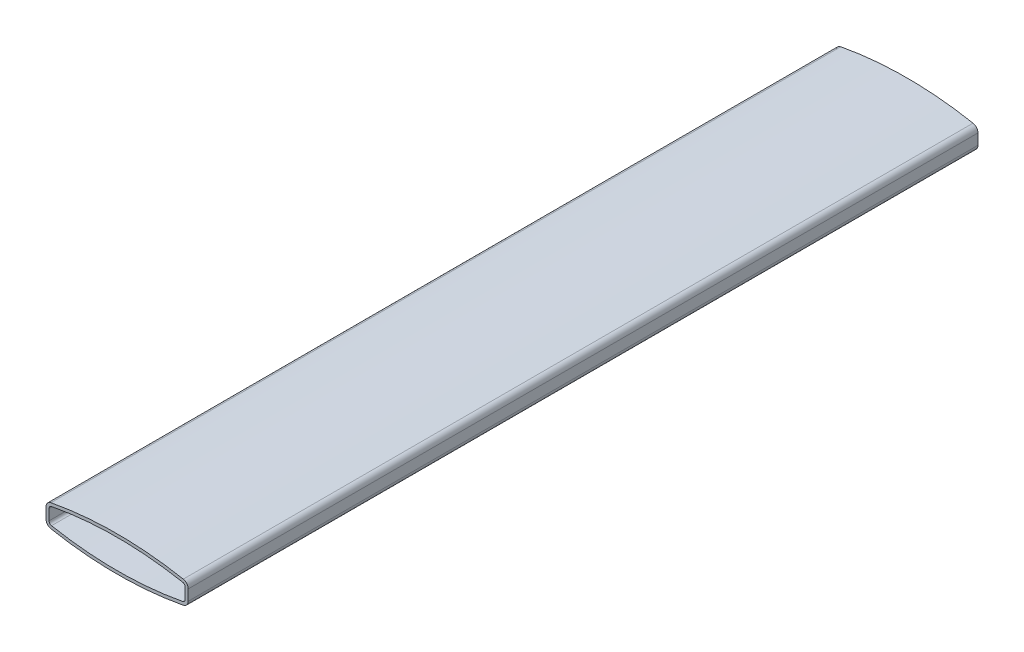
ISO-10303-21;
HEADER;
FILE_DESCRIPTION(('STEP AP214'),'2;1');
FILE_NAME('part.step','',(''),(''),'','','');
FILE_SCHEMA(('AUTOMOTIVE_DESIGN { 1 0 10303 214 1 1 1 1 }'));
ENDSEC;
DATA;
#1=APPLICATION_CONTEXT('core data for automotive mechanical design processes');
#2=APPLICATION_PROTOCOL_DEFINITION('international standard','automotive_design',2000,#1);
#3=PRODUCT_CONTEXT('',#1,'mechanical');
#4=PRODUCT('Part','Part','',(#3));
#5=PRODUCT_RELATED_PRODUCT_CATEGORY('part','',(#4));
#6=PRODUCT_DEFINITION_FORMATION('','',#4);
#7=PRODUCT_DEFINITION_CONTEXT('part definition',#1,'design');
#8=PRODUCT_DEFINITION('design','',#6,#7);
#9=PRODUCT_DEFINITION_SHAPE('','',#8);
#10=(LENGTH_UNIT() NAMED_UNIT(*) SI_UNIT(.MILLI.,.METRE.));
#11=(NAMED_UNIT(*) PLANE_ANGLE_UNIT() SI_UNIT($,.RADIAN.));
#12=(NAMED_UNIT(*) SI_UNIT($,.STERADIAN.) SOLID_ANGLE_UNIT());
#13=UNCERTAINTY_MEASURE_WITH_UNIT(LENGTH_MEASURE(1.E-05),#10,'distance_accuracy_value','');
#14=(GEOMETRIC_REPRESENTATION_CONTEXT(3) GLOBAL_UNCERTAINTY_ASSIGNED_CONTEXT((#13)) GLOBAL_UNIT_ASSIGNED_CONTEXT((#10,
#11,#12)) REPRESENTATION_CONTEXT('',''));
#15=CARTESIAN_POINT('',(0.,0.,0.));
#16=DIRECTION('',(0.,0.,1.));
#17=DIRECTION('',(1.,0.,0.));
#18=AXIS2_PLACEMENT_3D('',#15,#16,#17);
#19=CARTESIAN_POINT('',(0.,-166.375,0.));
#20=DIRECTION('',(0.,0.,1.));
#21=DIRECTION('',(1.,0.,0.));
#22=AXIS2_PLACEMENT_3D('',#19,#20,#21);
#23=PLANE('',#22);
#24=DIRECTION('',(0.,1.,0.));
#25=VECTOR('',#24,1.);
#26=CARTESIAN_POINT('',(35.,0.,0.));
#27=LINE('',#26,#25);
#28=CARTESIAN_POINT('',(35.,-2.62204139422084,0.));
#29=VERTEX_POINT('',#28);
#30=CARTESIAN_POINT('',(35.,2.62204139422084,0.));
#31=VERTEX_POINT('',#30);
#32=EDGE_CURVE('E226',#29,#31,#27,.T.);
#33=ORIENTED_EDGE('',*,*,#32,.F.);
#34=CARTESIAN_POINT('',(32.,-2.62204139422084,0.));
#35=DIRECTION('',(0.,0.,1.));
#36=DIRECTION('',(1.,0.,0.));
#37=AXIS2_PLACEMENT_3D('',#34,#35,#36);
#38=CIRCLE('',#37,3.);
#39=CARTESIAN_POINT('',(32.5581395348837,-5.56966420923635,0.));
#40=VERTEX_POINT('',#39);
#41=EDGE_CURVE('E241',#29,#40,#38,.F.);
#42=ORIENTED_EDGE('',*,*,#41,.T.);
#43=CARTESIAN_POINT('',(0.,166.375,0.));
#44=DIRECTION('',(0.,0.,1.));
#45=DIRECTION('',(1.,0.,0.));
#46=AXIS2_PLACEMENT_3D('',#43,#44,#45);
#47=CIRCLE('',#46,175.);
#48=CARTESIAN_POINT('',(-32.5581395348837,-5.56966420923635,0.));
#49=VERTEX_POINT('',#48);
#50=EDGE_CURVE('E223',#49,#40,#47,.T.);
#51=ORIENTED_EDGE('',*,*,#50,.F.);
#52=CARTESIAN_POINT('',(-32.,-2.62204139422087,0.));
#53=DIRECTION('',(0.,0.,1.));
#54=DIRECTION('',(1.,0.,0.));
#55=AXIS2_PLACEMENT_3D('',#52,#53,#54);
#56=CIRCLE('',#55,3.);
#57=CARTESIAN_POINT('',(-35.,-2.62204139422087,0.));
#58=VERTEX_POINT('',#57);
#59=EDGE_CURVE('E237',#49,#58,#56,.F.);
#60=ORIENTED_EDGE('',*,*,#59,.T.);
#61=DIRECTION('',(0.,-1.,0.));
#62=VECTOR('',#61,1.);
#63=CARTESIAN_POINT('',(-35.,0.,0.));
#64=LINE('',#63,#62);
#65=CARTESIAN_POINT('',(-35.,2.62204139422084,0.));
#66=VERTEX_POINT('',#65);
#67=EDGE_CURVE('E220',#66,#58,#64,.T.);
#68=ORIENTED_EDGE('',*,*,#67,.F.);
#69=CARTESIAN_POINT('',(-32.,2.62204139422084,0.));
#70=DIRECTION('',(0.,0.,1.));
#71=DIRECTION('',(1.,0.,0.));
#72=AXIS2_PLACEMENT_3D('',#69,#70,#71);
#73=CIRCLE('',#72,3.);
#74=CARTESIAN_POINT('',(-32.5581395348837,5.56966420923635,0.));
#75=VERTEX_POINT('',#74);
#76=EDGE_CURVE('E235',#66,#75,#73,.F.);
#77=ORIENTED_EDGE('',*,*,#76,.T.);
#78=CARTESIAN_POINT('',(0.,-166.375,0.));
#79=DIRECTION('',(0.,0.,1.));
#80=DIRECTION('',(1.,0.,0.));
#81=AXIS2_PLACEMENT_3D('',#78,#79,#80);
#82=CIRCLE('',#81,175.);
#83=CARTESIAN_POINT('',(32.5581395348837,5.56966420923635,0.));
#84=VERTEX_POINT('',#83);
#85=EDGE_CURVE('E210',#84,#75,#82,.T.);
#86=ORIENTED_EDGE('',*,*,#85,.F.);
#87=CARTESIAN_POINT('',(32.,2.62204139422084,0.));
#88=DIRECTION('',(0.,0.,1.));
#89=DIRECTION('',(1.,0.,0.));
#90=AXIS2_PLACEMENT_3D('',#87,#88,#89);
#91=CIRCLE('',#90,3.);
#92=EDGE_CURVE('E239',#84,#31,#91,.F.);
#93=ORIENTED_EDGE('',*,*,#92,.T.);
#94=EDGE_LOOP('',(#33,#42,#51,#60,#68,#77,#86,#93));
#95=FACE_BOUND('',#94,.T.);
#96=CARTESIAN_POINT('',(32.,-2.62204139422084,0.));
#97=DIRECTION('',(0.,0.,1.));
#98=DIRECTION('',(1.,0.,0.));
#99=AXIS2_PLACEMENT_3D('',#96,#97,#98);
#100=CIRCLE('',#99,1.5);
#101=CARTESIAN_POINT('',(33.5,-2.62204139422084,0.));
#102=VERTEX_POINT('',#101);
#103=CARTESIAN_POINT('',(32.2790697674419,-4.09585280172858,0.));
#104=VERTEX_POINT('',#103);
#105=EDGE_CURVE('E180',#102,#104,#100,.F.);
#106=ORIENTED_EDGE('',*,*,#105,.F.);
#107=DIRECTION('',(0.,1.,0.));
#108=VECTOR('',#107,1.);
#109=CARTESIAN_POINT('',(33.5,0.,0.));
#110=LINE('',#109,#108);
#111=CARTESIAN_POINT('',(33.5,2.62204139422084,0.));
#112=VERTEX_POINT('',#111);
#113=EDGE_CURVE('E178',#102,#112,#110,.T.);
#114=ORIENTED_EDGE('',*,*,#113,.T.);
#115=CARTESIAN_POINT('',(32.,2.62204139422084,0.));
#116=DIRECTION('',(0.,0.,1.));
#117=DIRECTION('',(1.,0.,0.));
#118=AXIS2_PLACEMENT_3D('',#115,#116,#117);
#119=CIRCLE('',#118,1.5);
#120=CARTESIAN_POINT('',(32.2790697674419,4.09585280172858,0.));
#121=VERTEX_POINT('',#120);
#122=EDGE_CURVE('E171',#121,#112,#119,.F.);
#123=ORIENTED_EDGE('',*,*,#122,.F.);
#124=CARTESIAN_POINT('',(0.,-166.375,0.));
#125=DIRECTION('',(0.,0.,1.));
#126=DIRECTION('',(1.,0.,0.));
#127=AXIS2_PLACEMENT_3D('',#124,#125,#126);
#128=CIRCLE('',#127,173.5);
#129=CARTESIAN_POINT('',(-32.2790697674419,4.09585280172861,0.));
#130=VERTEX_POINT('',#129);
#131=EDGE_CURVE('E58',#121,#130,#128,.T.);
#132=ORIENTED_EDGE('',*,*,#131,.T.);
#133=CARTESIAN_POINT('',(-32.,2.62204139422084,0.));
#134=DIRECTION('',(0.,0.,1.));
#135=DIRECTION('',(1.,0.,0.));
#136=AXIS2_PLACEMENT_3D('',#133,#134,#135);
#137=CIRCLE('',#136,1.5);
#138=CARTESIAN_POINT('',(-33.5,2.62204139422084,0.));
#139=VERTEX_POINT('',#138);
#140=EDGE_CURVE('E153',#139,#130,#137,.F.);
#141=ORIENTED_EDGE('',*,*,#140,.F.);
#142=DIRECTION('',(0.,-1.,0.));
#143=VECTOR('',#142,1.);
#144=CARTESIAN_POINT('',(-33.5,0.,0.));
#145=LINE('',#144,#143);
#146=CARTESIAN_POINT('',(-33.5,-2.62204139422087,0.));
#147=VERTEX_POINT('',#146);
#148=EDGE_CURVE('E160',#139,#147,#145,.T.);
#149=ORIENTED_EDGE('',*,*,#148,.T.);
#150=CARTESIAN_POINT('',(-32.,-2.62204139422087,0.));
#151=DIRECTION('',(0.,0.,1.));
#152=DIRECTION('',(1.,0.,0.));
#153=AXIS2_PLACEMENT_3D('',#150,#151,#152);
#154=CIRCLE('',#153,1.5);
#155=CARTESIAN_POINT('',(-32.2790697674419,-4.09585280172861,0.));
#156=VERTEX_POINT('',#155);
#157=EDGE_CURVE('E168',#156,#147,#154,.F.);
#158=ORIENTED_EDGE('',*,*,#157,.F.);
#159=CARTESIAN_POINT('',(0.,166.375,0.));
#160=DIRECTION('',(0.,0.,1.));
#161=DIRECTION('',(1.,0.,0.));
#162=AXIS2_PLACEMENT_3D('',#159,#160,#161);
#163=CIRCLE('',#162,173.5);
#164=EDGE_CURVE('E164',#156,#104,#163,.T.);
#165=ORIENTED_EDGE('',*,*,#164,.T.);
#166=EDGE_LOOP('',(#106,#114,#123,#132,#141,#149,#158,#165));
#167=FACE_BOUND('',#166,.T.);
#168=ADVANCED_FACE('F35',(#95,#167),#23,.F.);
#169=CARTESIAN_POINT('',(-35.,0.,388.65));
#170=DIRECTION('',(1.,0.,0.));
#171=DIRECTION('',(0.,1.,0.));
#172=AXIS2_PLACEMENT_3D('',#169,#170,#171);
#173=PLANE('',#172);
#174=ORIENTED_EDGE('',*,*,#67,.T.);
#175=DIRECTION('',(0.,0.,-1.));
#176=VECTOR('',#175,1.);
#177=CARTESIAN_POINT('',(-35.,-2.62204139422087,388.65));
#178=LINE('',#177,#176);
#179=CARTESIAN_POINT('',(-35.,-2.62204139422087,388.65));
#180=VERTEX_POINT('',#179);
#181=EDGE_CURVE('E11',#58,#180,#178,.F.);
#182=ORIENTED_EDGE('',*,*,#181,.T.);
#183=DIRECTION('',(0.,-1.,0.));
#184=VECTOR('',#183,1.);
#185=CARTESIAN_POINT('',(-35.,0.,388.65));
#186=LINE('',#185,#184);
#187=CARTESIAN_POINT('',(-35.,2.62204139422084,388.65));
#188=VERTEX_POINT('',#187);
#189=EDGE_CURVE('E206',#188,#180,#186,.T.);
#190=ORIENTED_EDGE('',*,*,#189,.F.);
#191=DIRECTION('',(0.,0.,-1.));
#192=VECTOR('',#191,1.);
#193=CARTESIAN_POINT('',(-35.,2.62204139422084,388.65));
#194=LINE('',#193,#192);
#195=EDGE_CURVE('E43',#188,#66,#194,.T.);
#196=ORIENTED_EDGE('',*,*,#195,.T.);
#197=EDGE_LOOP('',(#174,#182,#190,#196));
#198=FACE_BOUND('',#197,.T.);
#199=ADVANCED_FACE('F265',(#198),#173,.F.);
#200=CARTESIAN_POINT('',(0.,166.375,388.65));
#201=DIRECTION('',(0.,0.,-1.));
#202=DIRECTION('',(-1.,0.,0.));
#203=AXIS2_PLACEMENT_3D('',#200,#201,#202);
#204=CYLINDRICAL_SURFACE('',#203,175.);
#205=ORIENTED_EDGE('',*,*,#50,.T.);
#206=DIRECTION('',(0.,0.,-1.));
#207=VECTOR('',#206,1.);
#208=CARTESIAN_POINT('',(32.5581395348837,-5.56966420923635,388.65));
#209=LINE('',#208,#207);
#210=CARTESIAN_POINT('',(32.5581395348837,-5.56966420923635,388.65));
#211=VERTEX_POINT('',#210);
#212=EDGE_CURVE('E246',#40,#211,#209,.F.);
#213=ORIENTED_EDGE('',*,*,#212,.T.);
#214=CARTESIAN_POINT('',(0.,166.375,388.65));
#215=DIRECTION('',(0.,0.,1.));
#216=DIRECTION('',(1.,0.,0.));
#217=AXIS2_PLACEMENT_3D('',#214,#215,#216);
#218=CIRCLE('',#217,175.);
#219=CARTESIAN_POINT('',(-32.5581395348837,-5.56966420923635,388.65));
#220=VERTEX_POINT('',#219);
#221=EDGE_CURVE('E209',#220,#211,#218,.T.);
#222=ORIENTED_EDGE('',*,*,#221,.F.);
#223=DIRECTION('',(0.,0.,-1.));
#224=VECTOR('',#223,1.);
#225=CARTESIAN_POINT('',(-32.5581395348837,-5.56966420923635,388.65));
#226=LINE('',#225,#224);
#227=EDGE_CURVE('E243',#220,#49,#226,.T.);
#228=ORIENTED_EDGE('',*,*,#227,.T.);
#229=EDGE_LOOP('',(#205,#213,#222,#228));
#230=FACE_BOUND('',#229,.T.);
#231=ADVANCED_FACE('F279',(#230),#204,.T.);
#232=CARTESIAN_POINT('',(35.,0.,388.65));
#233=DIRECTION('',(-1.,0.,0.));
#234=DIRECTION('',(0.,0.,1.));
#235=AXIS2_PLACEMENT_3D('',#232,#233,#234);
#236=PLANE('',#235);
#237=DIRECTION('',(0.,1.,0.));
#238=VECTOR('',#237,1.);
#239=CARTESIAN_POINT('',(35.,0.,388.65));
#240=LINE('',#239,#238);
#241=CARTESIAN_POINT('',(35.,-2.62204139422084,388.65));
#242=VERTEX_POINT('',#241);
#243=CARTESIAN_POINT('',(35.,2.62204139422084,388.65));
#244=VERTEX_POINT('',#243);
#245=EDGE_CURVE('E213',#242,#244,#240,.T.);
#246=ORIENTED_EDGE('',*,*,#245,.F.);
#247=DIRECTION('',(0.,0.,-1.));
#248=VECTOR('',#247,1.);
#249=CARTESIAN_POINT('',(35.,-2.62204139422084,388.65));
#250=LINE('',#249,#248);
#251=EDGE_CURVE('E232',#242,#29,#250,.T.);
#252=ORIENTED_EDGE('',*,*,#251,.T.);
#253=ORIENTED_EDGE('',*,*,#32,.T.);
#254=DIRECTION('',(0.,0.,-1.));
#255=VECTOR('',#254,1.);
#256=CARTESIAN_POINT('',(35.,2.62204139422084,388.65));
#257=LINE('',#256,#255);
#258=EDGE_CURVE('E219',#31,#244,#257,.F.);
#259=ORIENTED_EDGE('',*,*,#258,.T.);
#260=EDGE_LOOP('',(#246,#252,#253,#259));
#261=FACE_BOUND('',#260,.T.);
#262=ADVANCED_FACE('F289',(#261),#236,.F.);
#263=CARTESIAN_POINT('',(0.,-166.375,388.65));
#264=DIRECTION('',(0.,0.,-1.));
#265=DIRECTION('',(-1.,0.,0.));
#266=AXIS2_PLACEMENT_3D('',#263,#264,#265);
#267=CYLINDRICAL_SURFACE('',#266,175.);
#268=CARTESIAN_POINT('',(0.,-166.375,388.65));
#269=DIRECTION('',(0.,0.,1.));
#270=DIRECTION('',(1.,0.,0.));
#271=AXIS2_PLACEMENT_3D('',#268,#269,#270);
#272=CIRCLE('',#271,175.);
#273=CARTESIAN_POINT('',(32.5581395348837,5.56966420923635,388.65));
#274=VERTEX_POINT('',#273);
#275=CARTESIAN_POINT('',(-32.5581395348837,5.56966420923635,388.65));
#276=VERTEX_POINT('',#275);
#277=EDGE_CURVE('E216',#274,#276,#272,.T.);
#278=ORIENTED_EDGE('',*,*,#277,.F.);
#279=DIRECTION('',(0.,0.,-1.));
#280=VECTOR('',#279,1.);
#281=CARTESIAN_POINT('',(32.5581395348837,5.56966420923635,388.65));
#282=LINE('',#281,#280);
#283=EDGE_CURVE('E258',#274,#84,#282,.T.);
#284=ORIENTED_EDGE('',*,*,#283,.T.);
#285=ORIENTED_EDGE('',*,*,#85,.T.);
#286=DIRECTION('',(0.,0.,-1.));
#287=VECTOR('',#286,1.);
#288=CARTESIAN_POINT('',(-32.5581395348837,5.56966420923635,388.65));
#289=LINE('',#288,#287);
#290=EDGE_CURVE('E256',#75,#276,#289,.F.);
#291=ORIENTED_EDGE('',*,*,#290,.T.);
#292=EDGE_LOOP('',(#278,#284,#285,#291));
#293=FACE_BOUND('',#292,.T.);
#294=ADVANCED_FACE('F297',(#293),#267,.T.);
#295=CARTESIAN_POINT('',(0.,-166.375,388.65));
#296=DIRECTION('',(0.,0.,1.));
#297=DIRECTION('',(1.,0.,0.));
#298=AXIS2_PLACEMENT_3D('',#295,#296,#297);
#299=PLANE('',#298);
#300=CARTESIAN_POINT('',(0.,166.375,388.65));
#301=DIRECTION('',(0.,0.,1.));
#302=DIRECTION('',(1.,0.,0.));
#303=AXIS2_PLACEMENT_3D('',#300,#301,#302);
#304=CIRCLE('',#303,173.5);
#305=CARTESIAN_POINT('',(-32.2790697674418,-4.09585280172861,388.65));
#306=VERTEX_POINT('',#305);
#307=CARTESIAN_POINT('',(32.2790697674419,-4.09585280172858,388.65));
#308=VERTEX_POINT('',#307);
#309=EDGE_CURVE('E188',#306,#308,#304,.T.);
#310=ORIENTED_EDGE('',*,*,#309,.F.);
#311=CARTESIAN_POINT('',(-32.,-2.62204139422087,388.65));
#312=DIRECTION('',(0.,0.,1.));
#313=DIRECTION('',(1.,0.,0.));
#314=AXIS2_PLACEMENT_3D('',#311,#312,#313);
#315=CIRCLE('',#314,1.5);
#316=CARTESIAN_POINT('',(-33.5,-2.62204139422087,388.65));
#317=VERTEX_POINT('',#316);
#318=EDGE_CURVE('E189',#317,#306,#315,.T.);
#319=ORIENTED_EDGE('',*,*,#318,.F.);
#320=DIRECTION('',(0.,-1.,0.));
#321=VECTOR('',#320,1.);
#322=CARTESIAN_POINT('',(-33.5,0.,388.65));
#323=LINE('',#322,#321);
#324=CARTESIAN_POINT('',(-33.5,2.62204139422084,388.65));
#325=VERTEX_POINT('',#324);
#326=EDGE_CURVE('E50',#325,#317,#323,.T.);
#327=ORIENTED_EDGE('',*,*,#326,.F.);
#328=CARTESIAN_POINT('',(-32.,2.62204139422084,388.65));
#329=DIRECTION('',(0.,0.,1.));
#330=DIRECTION('',(1.,0.,0.));
#331=AXIS2_PLACEMENT_3D('',#328,#329,#330);
#332=CIRCLE('',#331,1.5);
#333=CARTESIAN_POINT('',(-32.2790697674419,4.09585280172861,388.65));
#334=VERTEX_POINT('',#333);
#335=EDGE_CURVE('E155',#334,#325,#332,.T.);
#336=ORIENTED_EDGE('',*,*,#335,.F.);
#337=CARTESIAN_POINT('',(0.,-166.375,388.65));
#338=DIRECTION('',(0.,0.,1.));
#339=DIRECTION('',(1.,0.,0.));
#340=AXIS2_PLACEMENT_3D('',#337,#338,#339);
#341=CIRCLE('',#340,173.5);
#342=CARTESIAN_POINT('',(32.2790697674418,4.09585280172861,388.65));
#343=VERTEX_POINT('',#342);
#344=EDGE_CURVE('E200',#343,#334,#341,.T.);
#345=ORIENTED_EDGE('',*,*,#344,.F.);
#346=CARTESIAN_POINT('',(32.,2.62204139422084,388.65));
#347=DIRECTION('',(0.,0.,1.));
#348=DIRECTION('',(1.,0.,0.));
#349=AXIS2_PLACEMENT_3D('',#346,#347,#348);
#350=CIRCLE('',#349,1.5);
#351=CARTESIAN_POINT('',(33.5,2.62204139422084,388.65));
#352=VERTEX_POINT('',#351);
#353=EDGE_CURVE('E191',#352,#343,#350,.T.);
#354=ORIENTED_EDGE('',*,*,#353,.F.);
#355=DIRECTION('',(0.,1.,0.));
#356=VECTOR('',#355,1.);
#357=CARTESIAN_POINT('',(33.5,0.,388.65));
#358=LINE('',#357,#356);
#359=CARTESIAN_POINT('',(33.5,-2.62204139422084,388.65));
#360=VERTEX_POINT('',#359);
#361=EDGE_CURVE('E194',#360,#352,#358,.T.);
#362=ORIENTED_EDGE('',*,*,#361,.F.);
#363=CARTESIAN_POINT('',(32.,-2.62204139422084,388.65));
#364=DIRECTION('',(0.,0.,1.));
#365=DIRECTION('',(1.,0.,0.));
#366=AXIS2_PLACEMENT_3D('',#363,#364,#365);
#367=CIRCLE('',#366,1.5);
#368=EDGE_CURVE('E195',#308,#360,#367,.T.);
#369=ORIENTED_EDGE('',*,*,#368,.F.);
#370=EDGE_LOOP('',(#310,#319,#327,#336,#345,#354,#362,#369));
#371=FACE_BOUND('',#370,.T.);
#372=ORIENTED_EDGE('',*,*,#221,.T.);
#373=CARTESIAN_POINT('',(32.,-2.62204139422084,388.65));
#374=DIRECTION('',(0.,0.,1.));
#375=DIRECTION('',(1.,0.,0.));
#376=AXIS2_PLACEMENT_3D('',#373,#374,#375);
#377=CIRCLE('',#376,3.);
#378=EDGE_CURVE('E254',#211,#242,#377,.T.);
#379=ORIENTED_EDGE('',*,*,#378,.T.);
#380=ORIENTED_EDGE('',*,*,#245,.T.);
#381=CARTESIAN_POINT('',(32.,2.62204139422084,388.65));
#382=DIRECTION('',(0.,0.,1.));
#383=DIRECTION('',(1.,0.,0.));
#384=AXIS2_PLACEMENT_3D('',#381,#382,#383);
#385=CIRCLE('',#384,3.);
#386=EDGE_CURVE('E252',#244,#274,#385,.T.);
#387=ORIENTED_EDGE('',*,*,#386,.T.);
#388=ORIENTED_EDGE('',*,*,#277,.T.);
#389=CARTESIAN_POINT('',(-32.,2.62204139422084,388.65));
#390=DIRECTION('',(0.,0.,1.));
#391=DIRECTION('',(1.,0.,0.));
#392=AXIS2_PLACEMENT_3D('',#389,#390,#391);
#393=CIRCLE('',#392,3.);
#394=EDGE_CURVE('E248',#276,#188,#393,.T.);
#395=ORIENTED_EDGE('',*,*,#394,.T.);
#396=ORIENTED_EDGE('',*,*,#189,.T.);
#397=CARTESIAN_POINT('',(-32.,-2.62204139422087,388.65));
#398=DIRECTION('',(0.,0.,1.));
#399=DIRECTION('',(1.,0.,0.));
#400=AXIS2_PLACEMENT_3D('',#397,#398,#399);
#401=CIRCLE('',#400,3.);
#402=EDGE_CURVE('E250',#180,#220,#401,.T.);
#403=ORIENTED_EDGE('',*,*,#402,.T.);
#404=EDGE_LOOP('',(#372,#379,#380,#387,#388,#395,#396,#403));
#405=FACE_BOUND('',#404,.T.);
#406=ADVANCED_FACE('F283',(#371,#405),#299,.T.);
#407=CARTESIAN_POINT('',(32.,-2.62204139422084,388.65));
#408=DIRECTION('',(0.,0.,-1.));
#409=DIRECTION('',(-1.,0.,0.));
#410=AXIS2_PLACEMENT_3D('',#407,#408,#409);
#411=CYLINDRICAL_SURFACE('',#410,3.);
#412=ORIENTED_EDGE('',*,*,#378,.F.);
#413=ORIENTED_EDGE('',*,*,#212,.F.);
#414=ORIENTED_EDGE('',*,*,#41,.F.);
#415=ORIENTED_EDGE('',*,*,#251,.F.);
#416=EDGE_LOOP('',(#412,#413,#414,#415));
#417=FACE_BOUND('',#416,.T.);
#418=ADVANCED_FACE('F287',(#417),#411,.T.);
#419=CARTESIAN_POINT('',(32.,2.62204139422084,388.65));
#420=DIRECTION('',(0.,0.,-1.));
#421=DIRECTION('',(-1.,0.,0.));
#422=AXIS2_PLACEMENT_3D('',#419,#420,#421);
#423=CYLINDRICAL_SURFACE('',#422,3.);
#424=ORIENTED_EDGE('',*,*,#386,.F.);
#425=ORIENTED_EDGE('',*,*,#258,.F.);
#426=ORIENTED_EDGE('',*,*,#92,.F.);
#427=ORIENTED_EDGE('',*,*,#283,.F.);
#428=EDGE_LOOP('',(#424,#425,#426,#427));
#429=FACE_BOUND('',#428,.T.);
#430=ADVANCED_FACE('F294',(#429),#423,.T.);
#431=CARTESIAN_POINT('',(-32.,-2.62204139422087,388.65));
#432=DIRECTION('',(0.,0.,-1.));
#433=DIRECTION('',(-1.,0.,0.));
#434=AXIS2_PLACEMENT_3D('',#431,#432,#433);
#435=CYLINDRICAL_SURFACE('',#434,3.);
#436=ORIENTED_EDGE('',*,*,#402,.F.);
#437=ORIENTED_EDGE('',*,*,#181,.F.);
#438=ORIENTED_EDGE('',*,*,#59,.F.);
#439=ORIENTED_EDGE('',*,*,#227,.F.);
#440=EDGE_LOOP('',(#436,#437,#438,#439));
#441=FACE_BOUND('',#440,.T.);
#442=ADVANCED_FACE('F276',(#441),#435,.T.);
#443=CARTESIAN_POINT('',(-32.,2.62204139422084,388.65));
#444=DIRECTION('',(0.,0.,-1.));
#445=DIRECTION('',(-1.,0.,0.));
#446=AXIS2_PLACEMENT_3D('',#443,#444,#445);
#447=CYLINDRICAL_SURFACE('',#446,3.);
#448=ORIENTED_EDGE('',*,*,#394,.F.);
#449=ORIENTED_EDGE('',*,*,#290,.F.);
#450=ORIENTED_EDGE('',*,*,#76,.F.);
#451=ORIENTED_EDGE('',*,*,#195,.F.);
#452=EDGE_LOOP('',(#448,#449,#450,#451));
#453=FACE_BOUND('',#452,.T.);
#454=ADVANCED_FACE('F37',(#453),#447,.T.);
#455=CARTESIAN_POINT('',(-33.5,0.,388.65));
#456=DIRECTION('',(1.,0.,0.));
#457=DIRECTION('',(0.,1.,0.));
#458=AXIS2_PLACEMENT_3D('',#455,#456,#457);
#459=PLANE('',#458);
#460=ORIENTED_EDGE('',*,*,#148,.F.);
#461=DIRECTION('',(0.,0.,1.));
#462=VECTOR('',#461,1.);
#463=CARTESIAN_POINT('',(-33.5,2.62204139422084,388.65));
#464=LINE('',#463,#462);
#465=EDGE_CURVE('E149',#325,#139,#464,.F.);
#466=ORIENTED_EDGE('',*,*,#465,.F.);
#467=ORIENTED_EDGE('',*,*,#326,.T.);
#468=DIRECTION('',(0.,0.,1.));
#469=VECTOR('',#468,1.);
#470=CARTESIAN_POINT('',(-33.5,-2.62204139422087,388.65));
#471=LINE('',#470,#469);
#472=EDGE_CURVE('E156',#147,#317,#471,.T.);
#473=ORIENTED_EDGE('',*,*,#472,.F.);
#474=EDGE_LOOP('',(#460,#466,#467,#473));
#475=FACE_BOUND('',#474,.T.);
#476=ADVANCED_FACE('F161',(#475),#459,.T.);
#477=CARTESIAN_POINT('',(0.,166.375,388.65));
#478=DIRECTION('',(0.,0.,-1.));
#479=DIRECTION('',(-1.,0.,0.));
#480=AXIS2_PLACEMENT_3D('',#477,#478,#479);
#481=CYLINDRICAL_SURFACE('',#480,173.5);
#482=ORIENTED_EDGE('',*,*,#164,.F.);
#483=DIRECTION('',(0.,0.,-1.));
#484=VECTOR('',#483,1.);
#485=CARTESIAN_POINT('',(-32.2790697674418,-4.09585280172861,388.65));
#486=LINE('',#485,#484);
#487=EDGE_CURVE('E184',#306,#156,#486,.T.);
#488=ORIENTED_EDGE('',*,*,#487,.F.);
#489=ORIENTED_EDGE('',*,*,#309,.T.);
#490=DIRECTION('',(0.,0.,-1.));
#491=VECTOR('',#490,1.);
#492=CARTESIAN_POINT('',(32.2790697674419,-4.09585280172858,388.65));
#493=LINE('',#492,#491);
#494=EDGE_CURVE('E205',#104,#308,#493,.F.);
#495=ORIENTED_EDGE('',*,*,#494,.F.);
#496=EDGE_LOOP('',(#482,#488,#489,#495));
#497=FACE_BOUND('',#496,.T.);
#498=ADVANCED_FACE('F304',(#497),#481,.F.);
#499=CARTESIAN_POINT('',(33.5,0.,388.65));
#500=DIRECTION('',(-1.,0.,0.));
#501=DIRECTION('',(0.,0.,1.));
#502=AXIS2_PLACEMENT_3D('',#499,#500,#501);
#503=PLANE('',#502);
#504=ORIENTED_EDGE('',*,*,#361,.T.);
#505=DIRECTION('',(0.,0.,1.));
#506=VECTOR('',#505,1.);
#507=CARTESIAN_POINT('',(33.5,2.62204139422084,388.65));
#508=LINE('',#507,#506);
#509=EDGE_CURVE('E173',#112,#352,#508,.T.);
#510=ORIENTED_EDGE('',*,*,#509,.F.);
#511=ORIENTED_EDGE('',*,*,#113,.F.);
#512=DIRECTION('',(0.,0.,1.));
#513=VECTOR('',#512,1.);
#514=CARTESIAN_POINT('',(33.5,-2.62204139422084,388.65));
#515=LINE('',#514,#513);
#516=EDGE_CURVE('E169',#360,#102,#515,.F.);
#517=ORIENTED_EDGE('',*,*,#516,.F.);
#518=EDGE_LOOP('',(#504,#510,#511,#517));
#519=FACE_BOUND('',#518,.T.);
#520=ADVANCED_FACE('F366',(#519),#503,.T.);
#521=CARTESIAN_POINT('',(0.,-166.375,388.65));
#522=DIRECTION('',(0.,0.,-1.));
#523=DIRECTION('',(-1.,0.,0.));
#524=AXIS2_PLACEMENT_3D('',#521,#522,#523);
#525=CYLINDRICAL_SURFACE('',#524,173.5);
#526=ORIENTED_EDGE('',*,*,#344,.T.);
#527=DIRECTION('',(0.,0.,-1.));
#528=VECTOR('',#527,1.);
#529=CARTESIAN_POINT('',(-32.2790697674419,4.09585280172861,388.65));
#530=LINE('',#529,#528);
#531=EDGE_CURVE('E197',#130,#334,#530,.F.);
#532=ORIENTED_EDGE('',*,*,#531,.F.);
#533=ORIENTED_EDGE('',*,*,#131,.F.);
#534=DIRECTION('',(0.,0.,-1.));
#535=VECTOR('',#534,1.);
#536=CARTESIAN_POINT('',(32.2790697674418,4.09585280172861,388.65));
#537=LINE('',#536,#535);
#538=EDGE_CURVE('E157',#343,#121,#537,.T.);
#539=ORIENTED_EDGE('',*,*,#538,.F.);
#540=EDGE_LOOP('',(#526,#532,#533,#539));
#541=FACE_BOUND('',#540,.T.);
#542=ADVANCED_FACE('F377',(#541),#525,.F.);
#543=CARTESIAN_POINT('',(32.,-2.62204139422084,388.65));
#544=DIRECTION('',(0.,0.,-1.));
#545=DIRECTION('',(-1.,0.,0.));
#546=AXIS2_PLACEMENT_3D('',#543,#544,#545);
#547=CYLINDRICAL_SURFACE('',#546,1.5);
#548=ORIENTED_EDGE('',*,*,#368,.T.);
#549=ORIENTED_EDGE('',*,*,#516,.T.);
#550=ORIENTED_EDGE('',*,*,#105,.T.);
#551=ORIENTED_EDGE('',*,*,#494,.T.);
#552=EDGE_LOOP('',(#548,#549,#550,#551));
#553=FACE_BOUND('',#552,.T.);
#554=ADVANCED_FACE('F387',(#553),#547,.F.);
#555=CARTESIAN_POINT('',(32.,2.62204139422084,388.65));
#556=DIRECTION('',(0.,0.,-1.));
#557=DIRECTION('',(-1.,0.,0.));
#558=AXIS2_PLACEMENT_3D('',#555,#556,#557);
#559=CYLINDRICAL_SURFACE('',#558,1.5);
#560=ORIENTED_EDGE('',*,*,#353,.T.);
#561=ORIENTED_EDGE('',*,*,#538,.T.);
#562=ORIENTED_EDGE('',*,*,#122,.T.);
#563=ORIENTED_EDGE('',*,*,#509,.T.);
#564=EDGE_LOOP('',(#560,#561,#562,#563));
#565=FACE_BOUND('',#564,.T.);
#566=ADVANCED_FACE('F396',(#565),#559,.F.);
#567=CARTESIAN_POINT('',(-32.,-2.62204139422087,388.65));
#568=DIRECTION('',(0.,0.,-1.));
#569=DIRECTION('',(-1.,0.,0.));
#570=AXIS2_PLACEMENT_3D('',#567,#568,#569);
#571=CYLINDRICAL_SURFACE('',#570,1.5);
#572=ORIENTED_EDGE('',*,*,#318,.T.);
#573=ORIENTED_EDGE('',*,*,#487,.T.);
#574=ORIENTED_EDGE('',*,*,#157,.T.);
#575=ORIENTED_EDGE('',*,*,#472,.T.);
#576=EDGE_LOOP('',(#572,#573,#574,#575));
#577=FACE_BOUND('',#576,.T.);
#578=ADVANCED_FACE('F406',(#577),#571,.F.);
#579=CARTESIAN_POINT('',(-32.,2.62204139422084,388.65));
#580=DIRECTION('',(0.,0.,-1.));
#581=DIRECTION('',(-1.,0.,0.));
#582=AXIS2_PLACEMENT_3D('',#579,#580,#581);
#583=CYLINDRICAL_SURFACE('',#582,1.5);
#584=ORIENTED_EDGE('',*,*,#335,.T.);
#585=ORIENTED_EDGE('',*,*,#465,.T.);
#586=ORIENTED_EDGE('',*,*,#140,.T.);
#587=ORIENTED_EDGE('',*,*,#531,.T.);
#588=EDGE_LOOP('',(#584,#585,#586,#587));
#589=FACE_BOUND('',#588,.T.);
#590=ADVANCED_FACE('F151',(#589),#583,.F.);
#591=CLOSED_SHELL('',(#168,#199,#231,#262,#294,#406,#418,#430,#442,#454,#476,#498,#520,#542,
#554,#566,#578,#590));
#592=MANIFOLD_SOLID_BREP('B2',#591);
#593=ADVANCED_BREP_SHAPE_REPRESENTATION('',(#18,#592),#14);
#594=SHAPE_DEFINITION_REPRESENTATION(#9,#593);
ENDSEC;
END-ISO-10303-21;
